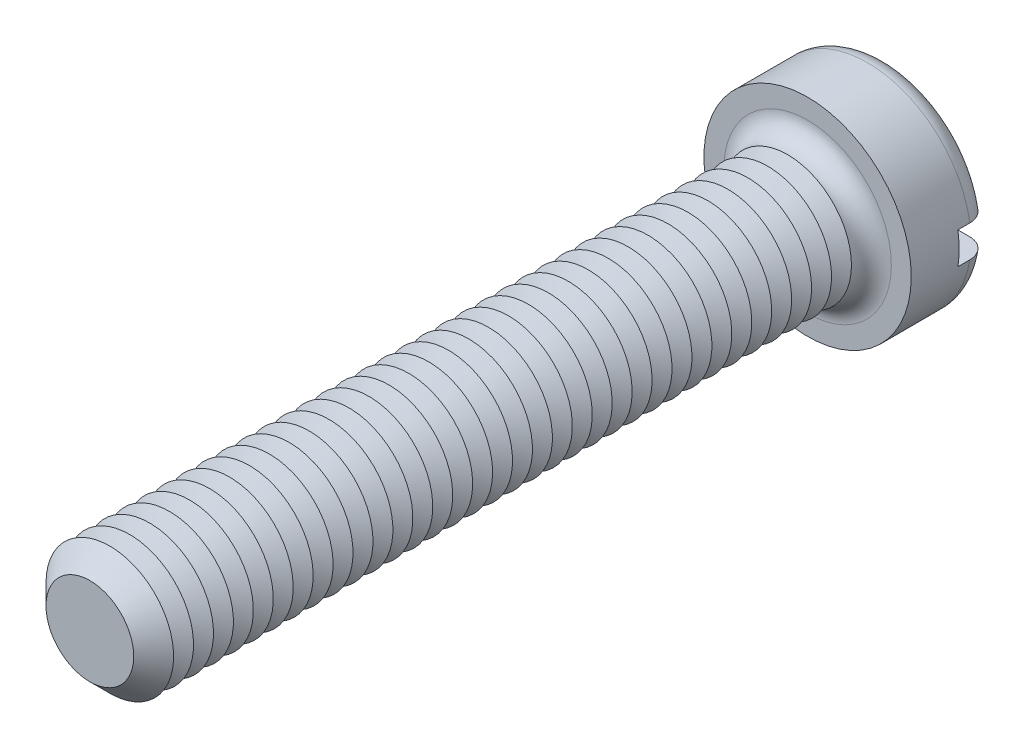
from build123d import *

# Parameters (mm, degrees)
SKETCH3_R           = 6.5
BOSS_EXTRUDE2_DEPTH = 5
SKETCH4_R           = 4
BOSS_EXTRUDE3_DEPTH = 45
FILLET1_R           = 1.25
CHAMFER1_SIZE       = 1.25
LPATTERN1_COUNT     = 34
LPATTERN1_PITCH     = 1.25
SKETCH8_W           = 13
SKETCH8_H           = 2
CUT_EXTRUDE1_DEPTH  = 2


with BuildPart() as part:
    # Sketch3 → Boss-Extrude2 (new body)
    with BuildSketch(Plane.XY):
        Circle(SKETCH3_R)
    extrude(amount=-BOSS_EXTRUDE2_DEPTH)

    # Sketch4 → Boss-Extrude3 (add)
    with BuildSketch(Plane.XY):
        with Locations(Location((0, 0, 0), (0, 0, 180))):
            Circle(SKETCH4_R)
    extrude(amount=BOSS_EXTRUDE3_DEPTH)

    # Fillet1
    fillet1_edges = [part.edges().sort_by_distance(p)[0] for p in [
        (-6.5, 0, -5),
        (4, 0, 0),
    ]]
    fillet(fillet1_edges, radius=FILLET1_R)

    # Chamfer1
    chamfer1_edges = [part.edges().sort_by_distance(p)[0] for p in [
        (4, 0, 45),
    ]]
    chamfer(chamfer1_edges, length=CHAMFER1_SIZE)

    # Sketch6 → Cut-Revolve1 (revolve, cut)
    with BuildSketch(Plane(origin=(0, 0, 0), x_dir=(0, 0, -1), z_dir=(1, 0, 0)), mode=Mode.PRIVATE) as cut_revolve1_sk:
        Polygon((-1.25, 4), (-1.875, 2.917468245), (-2.5, 4), align=None)
    cut_revolve1 = revolve(cut_revolve1_sk.sketch.rotate(Axis((0, 0, -1.694361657), (0, 0, 1)), 90), axis=Axis((0, 0, -1.694361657), (0, 0, 1)), mode=Mode.SUBTRACT)

    # LPattern1: Cut-Revolve1 ×34
    with Locations(*[(0, 0, i * LPATTERN1_PITCH) for i in range(1, LPATTERN1_COUNT)]):
        add(cut_revolve1, mode=Mode.SUBTRACT)

    # Sketch8 → Cut-Extrude1 (cut)
    with BuildSketch(Plane(origin=(0, 0, -5), x_dir=(-1, 0, 0), z_dir=(0, 0, -1))):
        Rectangle(SKETCH8_W, SKETCH8_H)
    extrude(amount=-CUT_EXTRUDE1_DEPTH, mode=Mode.SUBTRACT)


solid = part.part
